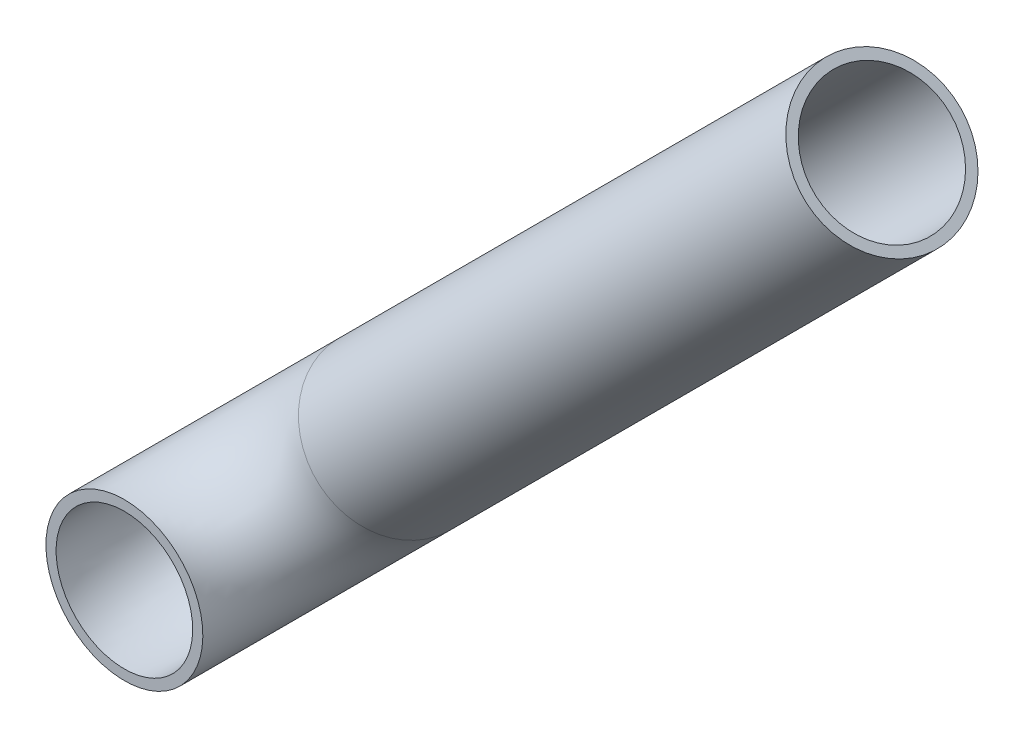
ISO-10303-21;
HEADER;
FILE_DESCRIPTION(('STEP AP214'),'2;1');
FILE_NAME('part.step','',(''),(''),'','','');
FILE_SCHEMA(('AUTOMOTIVE_DESIGN { 1 0 10303 214 1 1 1 1 }'));
ENDSEC;
DATA;
#1=APPLICATION_CONTEXT('core data for automotive mechanical design processes');
#2=APPLICATION_PROTOCOL_DEFINITION('international standard','automotive_design',2000,#1);
#3=PRODUCT_CONTEXT('',#1,'mechanical');
#4=PRODUCT('Part','Part','',(#3));
#5=PRODUCT_RELATED_PRODUCT_CATEGORY('part','',(#4));
#6=PRODUCT_DEFINITION_FORMATION('','',#4);
#7=PRODUCT_DEFINITION_CONTEXT('part definition',#1,'design');
#8=PRODUCT_DEFINITION('design','',#6,#7);
#9=PRODUCT_DEFINITION_SHAPE('','',#8);
#10=(LENGTH_UNIT() NAMED_UNIT(*) SI_UNIT(.MILLI.,.METRE.));
#11=(NAMED_UNIT(*) PLANE_ANGLE_UNIT() SI_UNIT($,.RADIAN.));
#12=(NAMED_UNIT(*) SI_UNIT($,.STERADIAN.) SOLID_ANGLE_UNIT());
#13=UNCERTAINTY_MEASURE_WITH_UNIT(LENGTH_MEASURE(1.E-05),#10,'distance_accuracy_value','');
#14=(GEOMETRIC_REPRESENTATION_CONTEXT(3) GLOBAL_UNCERTAINTY_ASSIGNED_CONTEXT((#13)) GLOBAL_UNIT_ASSIGNED_CONTEXT((#10,
#11,#12)) REPRESENTATION_CONTEXT('',''));
#15=CARTESIAN_POINT('',(0.,0.,0.));
#16=DIRECTION('',(0.,0.,1.));
#17=DIRECTION('',(1.,0.,0.));
#18=AXIS2_PLACEMENT_3D('',#15,#16,#17);
#19=CARTESIAN_POINT('',(43.1052293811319,43.1052293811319,-60.96));
#20=DIRECTION('',(0.707106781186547,0.707106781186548,0.));
#21=DIRECTION('',(-0.707106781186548,0.707106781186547,0.));
#22=AXIS2_PLACEMENT_3D('',#19,#20,#21);
#23=CYLINDRICAL_SURFACE('',#22,30.226);
#24=CARTESIAN_POINT('',(117.375941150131,106.91114115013,-90.2662289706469));
#25=CARTESIAN_POINT('',(117.37594124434,106.619289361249,-90.2141212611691));
#26=CARTESIAN_POINT('',(117.363728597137,106.327464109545,-90.1618780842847));
#27=CARTESIAN_POINT('',(117.314933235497,105.745650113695,-90.0585414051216));
#28=CARTESIAN_POINT('',(117.278350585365,105.455661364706,-90.0074478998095));
#29=CARTESIAN_POINT('',(117.180956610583,104.879306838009,-89.9078315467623));
#30=CARTESIAN_POINT('',(117.120143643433,104.592941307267,-89.8593088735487));
#31=CARTESIAN_POINT('',(116.97456850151,104.025809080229,-89.766254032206));
#32=CARTESIAN_POINT('',(116.889815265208,103.745040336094,-89.7217203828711));
#33=CARTESIAN_POINT('',(116.696499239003,103.190211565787,-89.6378542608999));
#34=CARTESIAN_POINT('',(116.587877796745,102.916169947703,-89.5985349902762));
#35=CARTESIAN_POINT('',(116.347517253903,102.377508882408,-89.526465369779));
#36=CARTESIAN_POINT('',(116.215778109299,102.112889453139,-89.4937150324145));
#37=CARTESIAN_POINT('',(115.930016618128,101.595192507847,-89.4358679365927));
#38=CARTESIAN_POINT('',(115.776001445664,101.342111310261,-89.4107687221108));
#39=CARTESIAN_POINT('',(115.446696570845,100.84944921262,-89.3690662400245));
#40=CARTESIAN_POINT('',(115.271407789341,100.609867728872,-89.3524626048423));
#41=CARTESIAN_POINT('',(114.908398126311,100.155626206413,-89.328822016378));
#42=CARTESIAN_POINT('',(114.721472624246,99.9403489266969,-89.3214235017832));
#43=CARTESIAN_POINT('',(114.330611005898,99.525704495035,-89.3152205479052));
#44=CARTESIAN_POINT('',(114.126675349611,99.3263369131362,-89.3164158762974));
#45=CARTESIAN_POINT('',(113.703363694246,98.9450320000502,-89.3273605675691));
#46=CARTESIAN_POINT('',(113.483989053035,98.7630931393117,-89.3371091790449));
#47=CARTESIAN_POINT('',(113.031472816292,98.4179347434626,-89.3648403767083));
#48=CARTESIAN_POINT('',(112.798331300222,98.2547151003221,-89.3828229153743));
#49=CARTESIAN_POINT('',(112.326838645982,97.9524330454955,-89.4258254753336));
#50=CARTESIAN_POINT('',(112.088822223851,97.8128172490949,-89.4506316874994));
#51=CARTESIAN_POINT('',(111.603034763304,97.5530392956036,-89.5067521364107));
#52=CARTESIAN_POINT('',(111.355260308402,97.4328840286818,-89.538068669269));
#53=CARTESIAN_POINT('',(110.85169365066,97.2127083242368,-89.6063140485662));
#54=CARTESIAN_POINT('',(110.595901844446,97.1126868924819,-89.6432426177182));
#55=CARTESIAN_POINT('',(110.077879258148,96.9332175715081,-89.7217083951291));
#56=CARTESIAN_POINT('',(109.815648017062,96.8537711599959,-89.7632459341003));
#57=CARTESIAN_POINT('',(109.275180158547,96.7128770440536,-89.8516624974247));
#58=CARTESIAN_POINT('',(108.996734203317,96.6523267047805,-89.8986926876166));
#59=CARTESIAN_POINT('',(108.436264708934,96.55416354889,-89.9952880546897));
#60=CARTESIAN_POINT('',(108.154241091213,96.5165512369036,-90.0448532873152));
#61=CARTESIAN_POINT('',(107.588204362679,96.4643988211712,-90.1452202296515));
#62=CARTESIAN_POINT('',(107.304190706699,96.4498653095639,-90.1960222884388));
#63=CARTESIAN_POINT('',(106.735910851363,96.4439504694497,-90.297534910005));
#64=CARTESIAN_POINT('',(106.451644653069,96.4525690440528,-90.3482454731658));
#65=CARTESIAN_POINT('',(105.870987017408,96.4939046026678,-90.4506697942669));
#66=CARTESIAN_POINT('',(105.574663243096,96.5277503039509,-90.5023162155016));
#67=CARTESIAN_POINT('',(104.985604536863,96.6206978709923,-90.6026360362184));
#68=CARTESIAN_POINT('',(104.692868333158,96.6797905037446,-90.6513105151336));
#69=CARTESIAN_POINT('',(104.112830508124,96.8229926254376,-90.7443541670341));
#70=CARTESIAN_POINT('',(103.825529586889,96.90710531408,-90.7887227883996));
#71=CARTESIAN_POINT('',(103.258474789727,97.0999362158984,-90.8718900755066));
#72=CARTESIAN_POINT('',(102.9787206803,97.2086536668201,-90.9106889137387));
#73=CARTESIAN_POINT('',(102.433350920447,97.4481248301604,-90.9810224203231));
#74=CARTESIAN_POINT('',(102.167579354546,97.5784915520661,-91.0126649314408));
#75=CARTESIAN_POINT('',(101.647443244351,97.8616551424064,-91.0685770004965));
#76=CARTESIAN_POINT('',(101.393078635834,98.0144518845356,-91.0928465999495));
#77=CARTESIAN_POINT('',(100.897881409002,98.3413836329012,-91.1333011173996));
#78=CARTESIAN_POINT('',(100.65704455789,98.5155119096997,-91.1494885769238));
#79=CARTESIAN_POINT('',(100.190804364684,98.8838524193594,-91.1733116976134));
#80=CARTESIAN_POINT('',(99.9654003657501,99.078063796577,-91.1809477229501));
#81=CARTESIAN_POINT('',(99.5428129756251,99.4747781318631,-91.1872793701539));
#82=CARTESIAN_POINT('',(99.3447799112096,99.6763702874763,-91.1864060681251));
#83=CARTESIAN_POINT('',(98.9657538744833,100.094797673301,-91.1767703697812));
#84=CARTESIAN_POINT('',(98.7847602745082,100.311632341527,-91.1680082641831));
#85=CARTESIAN_POINT('',(98.4410903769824,100.758920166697,-91.1428307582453));
#86=CARTESIAN_POINT('',(98.278413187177,100.989372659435,-91.1264157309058));
#87=CARTESIAN_POINT('',(97.9724380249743,101.462203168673,-91.0863683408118));
#88=CARTESIAN_POINT('',(97.8291402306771,101.704581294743,-91.0627359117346));
#89=CARTESIAN_POINT('',(97.5640342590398,102.197209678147,-91.0091221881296));
#90=CARTESIAN_POINT('',(97.4420389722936,102.447365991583,-90.979201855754));
#91=CARTESIAN_POINT('',(97.2185428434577,102.956045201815,-90.913626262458));
#92=CARTESIAN_POINT('',(97.1170493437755,103.214571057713,-90.8779689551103));
#93=CARTESIAN_POINT('',(96.9351014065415,103.738209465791,-90.8018099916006));
#94=CARTESIAN_POINT('',(96.8546462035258,104.003321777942,-90.7613085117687));
#95=CARTESIAN_POINT('',(96.7151043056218,104.538514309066,-90.6764420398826));
#96=CARTESIAN_POINT('',(96.656019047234,104.808594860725,-90.6320767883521));
#97=CARTESIAN_POINT('',(96.5573145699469,105.36409323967,-90.5385312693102));
#98=CARTESIAN_POINT('',(96.5186670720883,105.649662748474,-90.4892250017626));
#99=CARTESIAN_POINT('',(96.4650453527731,106.222706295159,-90.3888417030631));
#100=CARTESIAN_POINT('',(96.4500717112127,106.510180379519,-90.3377646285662));
#101=CARTESIAN_POINT('',(96.443838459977,107.085394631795,-90.2351538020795));
#102=CARTESIAN_POINT('',(96.4525860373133,107.373134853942,-90.1836199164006));
#103=CARTESIAN_POINT('',(96.493768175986,107.947073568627,-90.0814709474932));
#104=CARTESIAN_POINT('',(96.5262023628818,108.233272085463,-90.0308558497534));
#105=CARTESIAN_POINT('',(96.6162892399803,108.813064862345,-89.9300559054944));
#106=CARTESIAN_POINT('',(96.6748398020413,109.106535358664,-89.8799579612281));
#107=CARTESIAN_POINT('',(96.8170220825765,109.687885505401,-89.7837391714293));
#108=CARTESIAN_POINT('',(96.9006441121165,109.975767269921,-89.7376167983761));
#109=CARTESIAN_POINT('',(97.0925826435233,110.544030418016,-89.6507642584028));
#110=CARTESIAN_POINT('',(97.2008993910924,110.824411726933,-89.61003414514));
#111=CARTESIAN_POINT('',(97.4416410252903,111.375558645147,-89.5352953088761));
#112=CARTESIAN_POINT('',(97.5740648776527,111.646324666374,-89.5012862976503));
#113=CARTESIAN_POINT('',(97.8581177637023,112.168578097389,-89.4419976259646));
#114=CARTESIAN_POINT('',(98.0090959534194,112.420394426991,-89.4164978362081));
#115=CARTESIAN_POINT('',(98.3320520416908,112.91093212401,-89.3737850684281));
#116=CARTESIAN_POINT('',(98.5040295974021,113.149653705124,-89.3565719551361));
#117=CARTESIAN_POINT('',(98.8676770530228,113.611976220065,-89.3310289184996));
#118=CARTESIAN_POINT('',(99.0593402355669,113.835582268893,-89.3226959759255));
#119=CARTESIAN_POINT('',(99.4609145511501,114.265919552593,-89.3151955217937));
#120=CARTESIAN_POINT('',(99.6708249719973,114.472651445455,-89.3160276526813));
#121=CARTESIAN_POINT('',(100.095462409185,114.856964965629,-89.3265348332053));
#122=CARTESIAN_POINT('',(100.309325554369,115.035515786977,-89.3357326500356));
#123=CARTESIAN_POINT('',(100.750285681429,115.374785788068,-89.3620164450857));
#124=CARTESIAN_POINT('',(100.977382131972,115.535505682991,-89.3791021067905));
#125=CARTESIAN_POINT('',(101.443173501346,115.838095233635,-89.4206384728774));
#126=CARTESIAN_POINT('',(101.681869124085,115.979963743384,-89.4450896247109));
#127=CARTESIAN_POINT('',(102.169167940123,116.244014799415,-89.5006273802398));
#128=CARTESIAN_POINT('',(102.417771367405,116.366196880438,-89.5317141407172));
#129=CARTESIAN_POINT('',(102.925142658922,116.591091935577,-89.5998883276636));
#130=CARTESIAN_POINT('',(103.183973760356,116.693648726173,-89.6370198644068));
#131=CARTESIAN_POINT('',(103.70841100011,116.877675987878,-89.7160837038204));
#132=CARTESIAN_POINT('',(103.974019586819,116.95913871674,-89.7580177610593));
#133=CARTESIAN_POINT('',(104.510309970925,117.100594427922,-89.8455472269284));
#134=CARTESIAN_POINT('',(104.780992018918,117.160586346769,-89.8911428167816));
#135=CARTESIAN_POINT('',(105.325847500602,117.258871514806,-89.9848111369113));
#136=CARTESIAN_POINT('',(105.600021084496,117.297163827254,-90.0328839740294));
#137=CARTESIAN_POINT('',(106.165949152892,117.353464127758,-90.133065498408));
#138=CARTESIAN_POINT('',(106.457818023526,117.370197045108,-90.1852483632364));
#139=CARTESIAN_POINT('',(107.041812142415,117.379198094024,-90.28958105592));
#140=CARTESIAN_POINT('',(107.333937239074,117.371476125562,-90.341730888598));
#141=CARTESIAN_POINT('',(107.916942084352,117.331593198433,-90.4446470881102));
#142=CARTESIAN_POINT('',(108.207821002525,117.299417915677,-90.4954126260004));
#143=CARTESIAN_POINT('',(108.78621130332,117.210739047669,-90.5941487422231));
#144=CARTESIAN_POINT('',(109.073723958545,117.154244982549,-90.6421204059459));
#145=CARTESIAN_POINT('',(109.64936822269,117.01577068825,-90.734928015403));
#146=CARTESIAN_POINT('',(109.937395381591,116.933299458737,-90.7796812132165));
#147=CARTESIAN_POINT('',(110.50604447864,116.74366563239,-90.8636911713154));
#148=CARTESIAN_POINT('',(110.786666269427,116.636502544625,-90.9029478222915));
#149=CARTESIAN_POINT('',(111.338296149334,116.398110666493,-90.9748211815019));
#150=CARTESIAN_POINT('',(111.609306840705,116.266888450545,-91.0074396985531));
#151=CARTESIAN_POINT('',(112.139623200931,115.981186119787,-91.0650878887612));
#152=CARTESIAN_POINT('',(112.398929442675,115.826707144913,-91.0901179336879));
#153=CARTESIAN_POINT('',(112.892980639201,115.502601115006,-91.1309547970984));
#154=CARTESIAN_POINT('',(113.128300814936,115.333893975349,-91.1471076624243));
#155=CARTESIAN_POINT('',(113.584401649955,114.977330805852,-91.1713163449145));
#156=CARTESIAN_POINT('',(113.805182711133,114.789475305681,-91.1793723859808));
#157=CARTESIAN_POINT('',(114.230425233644,114.396059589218,-91.1871588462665));
#158=CARTESIAN_POINT('',(114.434890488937,114.190503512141,-91.1868912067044));
#159=CARTESIAN_POINT('',(114.825980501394,113.763237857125,-91.1780424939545));
#160=CARTESIAN_POINT('',(115.012605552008,113.541528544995,-91.1694615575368));
#161=CARTESIAN_POINT('',(115.359979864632,113.092300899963,-91.1447043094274));
#162=CARTESIAN_POINT('',(115.521437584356,112.865313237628,-91.1288252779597));
#163=CARTESIAN_POINT('',(115.825500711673,112.39963432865,-91.0900055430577));
#164=CARTESIAN_POINT('',(115.968106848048,112.160943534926,-91.0670651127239));
#165=CARTESIAN_POINT('',(116.233648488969,111.67348773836,-91.0147022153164));
#166=CARTESIAN_POINT('',(116.356580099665,111.424720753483,-90.9852784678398));
#167=CARTESIAN_POINT('',(116.582084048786,110.918834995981,-90.9206877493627));
#168=CARTESIAN_POINT('',(116.684654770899,110.661715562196,-90.885520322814));
#169=CARTESIAN_POINT('',(116.876074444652,110.120618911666,-90.8073915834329));
#170=CARTESIAN_POINT('',(116.963245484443,109.836103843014,-90.7640375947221));
#171=CARTESIAN_POINT('',(117.112941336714,109.261356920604,-90.6728775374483));
#172=CARTESIAN_POINT('',(117.175464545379,108.971124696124,-90.6250711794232));
#173=CARTESIAN_POINT('',(117.275602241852,108.386890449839,-90.5263233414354));
#174=CARTESIAN_POINT('',(117.313213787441,108.092887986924,-90.4753814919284));
#175=CARTESIAN_POINT('',(117.36338733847,107.502962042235,-90.3717495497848));
#176=CARTESIAN_POINT('',(117.375941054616,107.207037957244,-90.3190588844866));
#177=CARTESIAN_POINT('',(117.375941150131,106.91114115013,-90.2662289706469));
#178=B_SPLINE_CURVE_WITH_KNOTS('',3,(#24,#25,#26,#27,#28,#29,#30,#31,#32,#33,#34,#35,#36,#37,
#38,#39,#40,#41,#42,#43,#44,#45,#46,#47,#48,#49,#50,#51,#52,#53,#54,#55,#56,#57,#58,#59,#60,#61,
#62,#63,#64,#65,#66,#67,#68,#69,#70,#71,#72,#73,#74,#75,#76,#77,#78,#79,#80,#81,#82,#83,#84,#85,
#86,#87,#88,#89,#90,#91,#92,#93,#94,#95,#96,#97,#98,#99,#100,#101,#102,#103,#104,#105,#106,#107,
#108,#109,#110,#111,#112,#113,#114,#115,#116,#117,#118,#119,#120,#121,#122,#123,#124,#125,#126,
#127,#128,#129,#130,#131,#132,#133,#134,#135,#136,#137,#138,#139,#140,#141,#142,#143,#144,#145,
#146,#147,#148,#149,#150,#151,#152,#153,#154,#155,#156,#157,#158,#159,#160,#161,#162,#163,#164,
#165,#166,#167,#168,#169,#170,#171,#172,#173,#174,#175,#176,#177),.UNSPECIFIED.,.T.,.F.,(4,2,2,
2,2,2,2,2,2,2,2,2,2,2,2,2,2,2,2,2,2,2,2,2,2,2,2,2,2,2,2,2,2,2,2,2,2,2,2,2,2,2,2,2,2,2,2,2,2,2,2,
2,2,2,2,2,2,2,2,2,2,2,2,2,2,2,2,2,2,2,2,2,2,2,2,2,4),(0.,0.889145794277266,1.7782892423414,
2.66749297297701,3.55636514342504,4.44744650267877,5.33852955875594,6.22932627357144,
7.12008444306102,7.97462116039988,8.82913477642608,9.68357333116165,10.5380069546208,
11.3682339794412,12.1987543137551,13.0292336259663,13.8597725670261,14.7252370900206,
15.5907206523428,16.4564513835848,17.3221784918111,18.2291573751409,19.1358048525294,
20.0425683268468,20.949303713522,21.8412978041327,22.7332868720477,23.6249952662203,
24.5166656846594,25.3634093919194,26.210121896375,27.056793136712,27.903472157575,
28.7422928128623,29.5814133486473,30.4205033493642,31.2596497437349,32.135746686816,
33.0118650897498,33.888248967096,34.7646189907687,35.6737678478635,36.5825658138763,
37.4913728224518,38.4001408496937,39.2831471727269,40.1661390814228,41.0488306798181,
41.9314878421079,42.7667494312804,43.601977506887,44.4372563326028,45.2725548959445,
46.114247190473,46.9562479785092,47.7982904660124,48.6403693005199,49.5302570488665,
50.4197845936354,51.3098336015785,52.1995344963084,53.1071778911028,54.0148393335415,
54.9222531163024,55.8296224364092,56.6985218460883,57.567397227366,58.436069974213,
59.3047284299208,60.1407714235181,60.9767820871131,61.812958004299,62.6492002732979,
63.550206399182,64.4512711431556,65.3524422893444,66.2539114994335),.UNSPECIFIED.);
#179=CARTESIAN_POINT('',(117.375941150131,106.91114115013,-90.2662289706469));
#180=VERTEX_POINT('',#179);
#181=EDGE_CURVE('E57',#180,#180,#178,.T.);
#182=ORIENTED_EDGE('',*,*,#181,.F.);
#183=EDGE_LOOP('',(#182));
#184=FACE_BOUND('',#183,.T.);
#185=CARTESIAN_POINT('',(43.1052293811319,43.1052293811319,-60.96));
#186=DIRECTION('',(-0.707106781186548,-0.707106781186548,0.));
#187=DIRECTION('',(0.5,-0.5,0.707106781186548));
#188=AXIS2_PLACEMENT_3D('',#185,#186,#187);
#189=CIRCLE('',#188,30.226);
#190=CARTESIAN_POINT('',(43.1052293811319,43.1052293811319,-91.186));
#191=VERTEX_POINT('',#190);
#192=EDGE_CURVE('E43',#191,#191,#189,.T.);
#193=ORIENTED_EDGE('',*,*,#192,.F.);
#194=EDGE_LOOP('',(#193));
#195=FACE_BOUND('',#194,.T.);
#196=CARTESIAN_POINT('',(230.857687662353,230.857687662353,-60.96));
#197=DIRECTION('',(-0.707106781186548,-0.707106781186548,0.));
#198=DIRECTION('',(0.5,-0.5,0.707106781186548));
#199=AXIS2_PLACEMENT_3D('',#196,#197,#198);
#200=CIRCLE('',#199,30.226);
#201=CARTESIAN_POINT('',(245.970687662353,215.744687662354,-39.5869904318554));
#202=VERTEX_POINT('',#201);
#203=EDGE_CURVE('E10',#202,#202,#200,.T.);
#204=ORIENTED_EDGE('',*,*,#203,.T.);
#205=EDGE_LOOP('',(#204));
#206=FACE_BOUND('',#205,.T.);
#207=ADVANCED_FACE('F29',(#184,#195,#206),#23,.T.);
#208=CARTESIAN_POINT('',(43.1052293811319,43.1052293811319,-60.96));
#209=DIRECTION('',(0.707106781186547,0.707106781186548,0.));
#210=DIRECTION('',(-0.707106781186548,0.707106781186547,0.));
#211=AXIS2_PLACEMENT_3D('',#208,#209,#210);
#212=CYLINDRICAL_SURFACE('',#211,26.3144);
#213=CARTESIAN_POINT('',(117.375941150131,106.91114115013,-86.2125568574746));
#214=CARTESIAN_POINT('',(117.3759401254,107.200780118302,-86.2725705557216));
#215=CARTESIAN_POINT('',(117.363909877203,107.490543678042,-86.3323945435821));
#216=CARTESIAN_POINT('',(117.315781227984,108.068590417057,-86.4500939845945));
#217=CARTESIAN_POINT('',(117.279669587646,108.356872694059,-86.5079683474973));
#218=CARTESIAN_POINT('',(117.183343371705,108.930722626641,-86.620362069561));
#219=CARTESIAN_POINT('',(117.123077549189,109.216283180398,-86.6748740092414));
#220=CARTESIAN_POINT('',(116.97862950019,109.782203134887,-86.7789687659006));
#221=CARTESIAN_POINT('',(116.894448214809,110.062562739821,-86.8285517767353));
#222=CARTESIAN_POINT('',(116.702320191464,110.616676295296,-86.9215486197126));
#223=CARTESIAN_POINT('',(116.594330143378,110.890417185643,-86.9649509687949));
#224=CARTESIAN_POINT('',(116.355190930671,111.428740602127,-87.0442828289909));
#225=CARTESIAN_POINT('',(116.224040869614,111.69332277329,-87.0802120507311));
#226=CARTESIAN_POINT('',(115.939472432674,112.210993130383,-87.1435489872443));
#227=CARTESIAN_POINT('',(115.786074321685,112.464091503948,-87.1709643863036));
#228=CARTESIAN_POINT('',(115.457950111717,112.956943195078,-87.2165206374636));
#229=CARTESIAN_POINT('',(115.283225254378,113.196697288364,-87.2346620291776));
#230=CARTESIAN_POINT('',(114.922588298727,113.649726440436,-87.2605035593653));
#231=CARTESIAN_POINT('',(114.737609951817,113.863719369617,-87.268661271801));
#232=CARTESIAN_POINT('',(114.350851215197,114.276102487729,-87.2758637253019));
#233=CARTESIAN_POINT('',(114.149071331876,114.474493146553,-87.2749087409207));
#234=CARTESIAN_POINT('',(113.73025103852,114.854167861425,-87.2639120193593));
#235=CARTESIAN_POINT('',(113.513210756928,115.035452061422,-87.2538703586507));
#236=CARTESIAN_POINT('',(113.065552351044,115.379610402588,-87.2249727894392));
#237=CARTESIAN_POINT('',(112.834934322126,115.542484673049,-87.2061169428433));
#238=CARTESIAN_POINT('',(112.369009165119,115.844136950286,-87.1607886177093));
#239=CARTESIAN_POINT('',(112.134050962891,115.983491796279,-87.1345619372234));
#240=CARTESIAN_POINT('',(111.654688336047,116.243080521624,-87.0749406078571));
#241=CARTESIAN_POINT('',(111.410284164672,116.363314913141,-87.0415461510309));
#242=CARTESIAN_POINT('',(110.913681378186,116.584069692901,-86.9683959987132));
#243=CARTESIAN_POINT('',(110.661483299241,116.684591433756,-86.9286407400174));
#244=CARTESIAN_POINT('',(110.150776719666,116.865548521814,-86.8436860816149));
#245=CARTESIAN_POINT('',(109.892265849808,116.945976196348,-86.7984846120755));
#246=CARTESIAN_POINT('',(109.359267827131,117.089458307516,-86.7016359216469));
#247=CARTESIAN_POINT('',(109.084573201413,117.151611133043,-86.6497944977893));
#248=CARTESIAN_POINT('',(108.531651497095,117.253531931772,-86.5425830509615));
#249=CARTESIAN_POINT('',(108.25342322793,117.293292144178,-86.487211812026));
#250=CARTESIAN_POINT('',(107.695050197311,117.350312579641,-86.3742901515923));
#251=CARTESIAN_POINT('',(107.414905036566,117.367567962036,-86.3167392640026));
#252=CARTESIAN_POINT('',(106.854285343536,117.379542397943,-86.2008692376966));
#253=CARTESIAN_POINT('',(106.573810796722,117.374260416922,-86.1425500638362));
#254=CARTESIAN_POINT('',(105.996792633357,117.340167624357,-86.0230094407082));
#255=CARTESIAN_POINT('',(105.700323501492,117.309927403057,-85.9618305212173));
#256=CARTESIAN_POINT('',(105.110646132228,117.224190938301,-85.8420015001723));
#257=CARTESIAN_POINT('',(104.81743683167,117.16870319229,-85.783350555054));
#258=CARTESIAN_POINT('',(104.235927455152,117.032626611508,-85.6702794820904));
#259=CARTESIAN_POINT('',(103.947629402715,116.95202768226,-85.6158610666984));
#260=CARTESIAN_POINT('',(103.378163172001,116.766077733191,-85.513015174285));
#261=CARTESIAN_POINT('',(103.096991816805,116.660737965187,-85.4645849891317));
#262=CARTESIAN_POINT('',(102.5465228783,116.426951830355,-85.3757504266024));
#263=CARTESIAN_POINT('',(102.277134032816,116.298749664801,-85.3352699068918));
#264=CARTESIAN_POINT('',(101.749370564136,116.019232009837,-85.2631313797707));
#265=CARTESIAN_POINT('',(101.49099592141,115.86791656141,-85.2314733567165));
#266=CARTESIAN_POINT('',(100.987599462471,115.543252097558,-85.1781512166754));
#267=CARTESIAN_POINT('',(100.742569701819,115.369916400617,-85.1564810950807));
#268=CARTESIAN_POINT('',(100.26787903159,115.002443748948,-85.1239331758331));
#269=CARTESIAN_POINT('',(100.038216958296,114.808308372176,-85.1130545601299));
#270=CARTESIAN_POINT('',(99.6131310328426,114.416353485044,-85.102909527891));
#271=CARTESIAN_POINT('',(99.4164316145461,114.219935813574,-85.1028232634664));
#272=CARTESIAN_POINT('',(99.0393932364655,113.812207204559,-85.1122209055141));
#273=CARTESIAN_POINT('',(98.8590533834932,113.600897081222,-85.1217042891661));
#274=CARTESIAN_POINT('',(98.5160145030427,113.165005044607,-85.1499246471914));
#275=CARTESIAN_POINT('',(98.3533154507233,112.940423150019,-85.1686616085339));
#276=CARTESIAN_POINT('',(98.0466095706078,112.479687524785,-85.2147782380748));
#277=CARTESIAN_POINT('',(97.9026029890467,112.243533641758,-85.2421580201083));
#278=CARTESIAN_POINT('',(97.636651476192,111.765950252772,-85.3041065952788));
#279=CARTESIAN_POINT('',(97.5143404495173,111.52470530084,-85.3385294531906));
#280=CARTESIAN_POINT('',(97.2890366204,111.034246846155,-85.4138841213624));
#281=CARTESIAN_POINT('',(97.1860506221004,110.785030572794,-85.4548182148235));
#282=CARTESIAN_POINT('',(96.9998547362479,110.280238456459,-85.5420652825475));
#283=CARTESIAN_POINT('',(96.9166452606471,110.024662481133,-85.588378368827));
#284=CARTESIAN_POINT('',(96.7702730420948,109.508598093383,-85.6851816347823));
#285=CARTESIAN_POINT('',(96.7071119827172,109.248109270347,-85.7356721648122));
#286=CARTESIAN_POINT('',(96.5973933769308,108.705676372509,-85.8431356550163));
#287=CARTESIAN_POINT('',(96.5522667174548,108.423483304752,-85.9003157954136));
#288=CARTESIAN_POINT('',(96.485242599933,107.856718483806,-86.0164762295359));
#289=CARTESIAN_POINT('',(96.4633459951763,107.572146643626,-86.0754565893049));
#290=CARTESIAN_POINT('',(96.4428496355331,107.002116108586,-86.193704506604));
#291=CARTESIAN_POINT('',(96.444258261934,106.716657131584,-86.2529721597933));
#292=CARTESIAN_POINT('',(96.4704094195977,106.146559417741,-86.3702652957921));
#293=CARTESIAN_POINT('',(96.4951515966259,105.861920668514,-86.4282907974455));
#294=CARTESIAN_POINT('',(96.5698009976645,105.280504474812,-86.5445565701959));
#295=CARTESIAN_POINT('',(96.6209363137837,104.983855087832,-86.6026545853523));
#296=CARTESIAN_POINT('',(96.7487856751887,104.395350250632,-86.7142209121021));
#297=CARTESIAN_POINT('',(96.8254898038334,104.103492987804,-86.7676910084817));
#298=CARTESIAN_POINT('',(97.004191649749,103.526530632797,-86.8685140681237));
#299=CARTESIAN_POINT('',(97.1061891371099,103.241425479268,-86.9158670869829));
#300=CARTESIAN_POINT('',(97.3349901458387,102.680160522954,-87.0030821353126));
#301=CARTESIAN_POINT('',(97.4617923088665,102.404000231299,-87.0429445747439));
#302=CARTESIAN_POINT('',(97.7343805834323,101.872794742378,-87.1126932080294));
#303=CARTESIAN_POINT('',(97.8793016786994,101.617346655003,-87.1428912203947));
#304=CARTESIAN_POINT('',(98.1905722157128,101.118901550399,-87.1943799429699));
#305=CARTESIAN_POINT('',(98.3569212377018,100.875904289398,-87.215670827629));
#306=CARTESIAN_POINT('',(98.7097986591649,100.404476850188,-87.2487210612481));
#307=CARTESIAN_POINT('',(98.8963195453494,100.176041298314,-87.260483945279));
#308=CARTESIAN_POINT('',(99.2881395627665,99.7355745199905,-87.2741438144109));
#309=CARTESIAN_POINT('',(99.4934378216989,99.5235425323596,-87.276041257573));
#310=CARTESIAN_POINT('',(99.9079078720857,99.1301843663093,-87.270106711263));
#311=CARTESIAN_POINT('',(100.116057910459,98.9477706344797,-87.2628681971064));
#312=CARTESIAN_POINT('',(100.545851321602,98.6002148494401,-87.2398507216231));
#313=CARTESIAN_POINT('',(100.767494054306,98.4350719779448,-87.2240721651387));
#314=CARTESIAN_POINT('',(101.222634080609,98.1231353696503,-87.1843809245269));
#315=CARTESIAN_POINT('',(101.456131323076,97.9763415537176,-87.1604682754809));
#316=CARTESIAN_POINT('',(101.933297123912,97.701968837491,-87.1051133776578));
#317=CARTESIAN_POINT('',(102.176965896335,97.5743903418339,-87.0736709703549));
#318=CARTESIAN_POINT('',(102.673252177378,97.338893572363,-87.0039675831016));
#319=CARTESIAN_POINT('',(102.925885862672,97.2310132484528,-86.9656937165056));
#320=CARTESIAN_POINT('',(103.438088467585,97.0356612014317,-86.8832794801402));
#321=CARTESIAN_POINT('',(103.69765983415,96.9481967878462,-86.8391370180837));
#322=CARTESIAN_POINT('',(104.222057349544,96.7940486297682,-86.7460372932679));
#323=CARTESIAN_POINT('',(104.486883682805,96.7273656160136,-86.697079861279));
#324=CARTESIAN_POINT('',(105.020260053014,96.6149817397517,-86.5954835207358));
#325=CARTESIAN_POINT('',(105.288810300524,96.5692820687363,-86.5428444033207));
#326=CARTESIAN_POINT('',(105.844859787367,96.4968010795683,-86.4317531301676));
#327=CARTESIAN_POINT('',(106.132503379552,96.4713652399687,-86.3731428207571));
#328=CARTESIAN_POINT('',(106.708646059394,96.4443263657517,-86.2546342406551));
#329=CARTESIAN_POINT('',(106.997145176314,96.442724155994,-86.1947359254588));
#330=CARTESIAN_POINT('',(107.573443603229,96.4633397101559,-86.0751873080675));
#331=CARTESIAN_POINT('',(107.861242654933,96.4855652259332,-86.0155370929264));
#332=CARTESIAN_POINT('',(108.434430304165,96.5537794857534,-85.8980843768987));
#333=CARTESIAN_POINT('',(108.719818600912,96.5997711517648,-85.8402821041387));
#334=CARTESIAN_POINT('',(109.297926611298,96.7177218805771,-85.7258598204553));
#335=CARTESIAN_POINT('',(109.59047663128,96.7906550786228,-85.669381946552));
#336=CARTESIAN_POINT('',(110.169003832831,96.9618032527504,-85.5619553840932));
#337=CARTESIAN_POINT('',(110.454983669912,97.0600078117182,-85.5110044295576));
#338=CARTESIAN_POINT('',(111.018355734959,97.2812713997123,-85.4163036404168));
#339=CARTESIAN_POINT('',(111.295749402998,97.4043262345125,-85.372552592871));
#340=CARTESIAN_POINT('',(111.839774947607,97.6746458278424,-85.29378600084));
#341=CARTESIAN_POINT('',(112.106407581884,97.8219088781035,-85.2587698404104));
#342=CARTESIAN_POINT('',(112.613951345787,98.1319570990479,-85.2002355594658));
#343=CARTESIAN_POINT('',(112.855482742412,98.2936370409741,-85.1762405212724));
#344=CARTESIAN_POINT('',(113.324754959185,98.6369581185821,-85.1381785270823));
#345=CARTESIAN_POINT('',(113.552496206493,98.8185986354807,-85.1241112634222));
#346=CARTESIAN_POINT('',(113.992155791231,99.2003698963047,-85.1064217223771));
#347=CARTESIAN_POINT('',(114.204081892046,99.4004914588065,-85.1027942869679));
#348=CARTESIAN_POINT('',(114.610455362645,99.8176665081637,-85.1061046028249));
#349=CARTESIAN_POINT('',(114.804903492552,100.034719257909,-85.1130418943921));
#350=CARTESIAN_POINT('',(115.162428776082,100.468933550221,-85.13641488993));
#351=CARTESIAN_POINT('',(115.32673317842,100.685122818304,-85.1521864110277));
#352=CARTESIAN_POINT('',(115.637726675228,101.129082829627,-85.192207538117));
#353=CARTESIAN_POINT('',(115.784415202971,101.356853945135,-85.2164574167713));
#354=CARTESIAN_POINT('',(116.059419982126,101.822506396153,-85.2727152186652));
#355=CARTESIAN_POINT('',(116.18772393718,102.060394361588,-85.3047282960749));
#356=CARTESIAN_POINT('',(116.425211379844,102.544539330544,-85.3755681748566));
#357=CARTESIAN_POINT('',(116.534394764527,102.790796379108,-85.4143950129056));
#358=CARTESIAN_POINT('',(116.735755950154,103.296589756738,-85.4988622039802));
#359=CARTESIAN_POINT('',(116.827421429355,103.556304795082,-85.5446526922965));
#360=CARTESIAN_POINT('',(116.989818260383,104.081332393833,-85.6410026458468));
#361=CARTESIAN_POINT('',(117.060549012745,104.346645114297,-85.6915622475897));
#362=CARTESIAN_POINT('',(117.180747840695,104.880857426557,-85.7960243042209));
#363=CARTESIAN_POINT('',(117.230254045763,105.149749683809,-85.8499205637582));
#364=CARTESIAN_POINT('',(117.308037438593,105.690063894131,-85.959774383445));
#365=CARTESIAN_POINT('',(117.336324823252,105.961484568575,-86.0157309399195));
#366=CARTESIAN_POINT('',(117.361296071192,106.34626313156,-86.0953990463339));
#367=CARTESIAN_POINT('',(117.366787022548,106.459166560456,-86.1188170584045));
#368=CARTESIAN_POINT('',(117.374109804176,106.685087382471,-86.1656852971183));
#369=CARTESIAN_POINT('',(117.375941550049,106.79810477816,-86.1891355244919));
#370=CARTESIAN_POINT('',(117.375941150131,106.91114115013,-86.2125568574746));
#371=B_SPLINE_CURVE_WITH_KNOTS('',3,(#213,#214,#215,#216,#217,#218,#219,#220,#221,#222,#223,
#224,#225,#226,#227,#228,#229,#230,#231,#232,#233,#234,#235,#236,#237,#238,#239,#240,#241,#242,
#243,#244,#245,#246,#247,#248,#249,#250,#251,#252,#253,#254,#255,#256,#257,#258,#259,#260,#261,
#262,#263,#264,#265,#266,#267,#268,#269,#270,#271,#272,#273,#274,#275,#276,#277,#278,#279,#280,
#281,#282,#283,#284,#285,#286,#287,#288,#289,#290,#291,#292,#293,#294,#295,#296,#297,#298,#299,
#300,#301,#302,#303,#304,#305,#306,#307,#308,#309,#310,#311,#312,#313,#314,#315,#316,#317,#318,
#319,#320,#321,#322,#323,#324,#325,#326,#327,#328,#329,#330,#331,#332,#333,#334,#335,#336,#337,
#338,#339,#340,#341,#342,#343,#344,#345,#346,#347,#348,#349,#350,#351,#352,#353,#354,#355,#356,
#357,#358,#359,#360,#361,#362,#363,#364,#365,#366,#367,#368,#369,#370),.UNSPECIFIED.,.T.,.F.,(4,
2,2,2,2,2,2,2,2,2,2,2,2,2,2,2,2,2,2,2,2,2,2,2,2,2,2,2,2,2,2,2,2,2,2,2,2,2,2,2,2,2,2,2,2,2,2,2,2,
2,2,2,2,2,2,2,2,2,2,2,2,2,2,2,2,2,2,2,2,2,2,2,2,2,2,2,2,2,4),(0.,0.887271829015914,
1.77503185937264,2.66468546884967,3.55430407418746,4.44555452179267,5.33683947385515,
6.22731762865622,7.11774396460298,7.9656148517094,8.8134601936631,9.6612984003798,
10.5091306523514,11.3314960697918,12.1538394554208,12.9761263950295,13.798726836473,
14.6568970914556,15.5153645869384,16.3740167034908,17.2327082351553,18.1442980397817,
19.0555812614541,19.9672312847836,20.8784675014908,21.780497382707,22.6825256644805,
23.5840109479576,24.4854278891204,25.3183230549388,26.1511727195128,26.9840212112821,
27.8168806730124,28.6339704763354,29.4513474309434,30.2687414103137,31.0862040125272,
31.9595714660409,32.8329709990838,33.7066846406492,34.5803850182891,35.4989926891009,
36.4172444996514,37.3354879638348,38.2536811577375,39.1382572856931,40.0228160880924,
40.907046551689,41.7912359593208,42.6208343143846,43.4503933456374,44.2799487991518,
45.109521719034,45.9406763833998,46.7721281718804,47.6036091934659,48.4351374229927,
49.3181145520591,50.2011222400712,51.0844172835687,51.9678209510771,52.8869188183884,
53.8056384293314,54.7242031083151,55.6427029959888,56.5164707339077,57.3902113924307,
58.2635202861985,59.1367911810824,59.9518337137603,60.766902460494,61.5825138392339,
62.3981296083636,63.2348207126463,64.071535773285,64.9067413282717,65.7415452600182,
66.0878097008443,66.4340821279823),.UNSPECIFIED.);
#372=CARTESIAN_POINT('',(117.375941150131,106.91114115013,-86.2125568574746));
#373=VERTEX_POINT('',#372);
#374=EDGE_CURVE('E32',#373,#373,#371,.T.);
#375=ORIENTED_EDGE('',*,*,#374,.F.);
#376=EDGE_LOOP('',(#375));
#377=FACE_BOUND('',#376,.T.);
#378=CARTESIAN_POINT('',(43.1052293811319,43.1052293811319,-60.96));
#379=DIRECTION('',(-0.707106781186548,-0.707106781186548,0.));
#380=DIRECTION('',(0.5,-0.5,0.707106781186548));
#381=AXIS2_PLACEMENT_3D('',#378,#379,#380);
#382=CIRCLE('',#381,26.3144);
#383=CARTESIAN_POINT('',(43.1052293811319,43.1052293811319,-87.2744));
#384=VERTEX_POINT('',#383);
#385=EDGE_CURVE('E48',#384,#384,#382,.T.);
#386=ORIENTED_EDGE('',*,*,#385,.T.);
#387=EDGE_LOOP('',(#386));
#388=FACE_BOUND('',#387,.T.);
#389=CARTESIAN_POINT('',(230.857687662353,230.857687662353,-60.96));
#390=DIRECTION('',(-0.707106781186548,-0.707106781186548,0.));
#391=DIRECTION('',(0.5,-0.5,0.707106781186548));
#392=AXIS2_PLACEMENT_3D('',#389,#390,#391);
#393=CIRCLE('',#392,26.3144);
#394=CARTESIAN_POINT('',(244.014887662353,217.700487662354,-42.3529093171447));
#395=VERTEX_POINT('',#394);
#396=EDGE_CURVE('E39',#395,#395,#393,.T.);
#397=ORIENTED_EDGE('',*,*,#396,.F.);
#398=EDGE_LOOP('',(#397));
#399=FACE_BOUND('',#398,.T.);
#400=ADVANCED_FACE('F78',(#377,#388,#399),#212,.F.);
#401=CARTESIAN_POINT('',(43.105229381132,43.105229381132,0.));
#402=DIRECTION('',(-0.707106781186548,0.707106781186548,0.));
#403=DIRECTION('',(-0.707106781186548,-0.707106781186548,0.));
#404=AXIS2_PLACEMENT_3D('',#401,#402,#403);
#405=TOROIDAL_SURFACE('',#404,60.96,26.3144);
#406=CARTESIAN_POINT('',(0.,0.,0.));
#407=DIRECTION('',(0.,0.,1.));
#408=DIRECTION('',(1.,0.,0.));
#409=AXIS2_PLACEMENT_3D('',#406,#407,#408);
#410=CIRCLE('',#409,26.3144);
#411=CARTESIAN_POINT('',(-18.6070906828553,-18.6070906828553,0.));
#412=VERTEX_POINT('',#411);
#413=EDGE_CURVE('E54',#412,#412,#410,.T.);
#414=CARTESIAN_POINT('',(43.105229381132,43.105229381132,0.));
#415=DIRECTION('',(-0.707106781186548,0.707106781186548,0.));
#416=DIRECTION('',(-0.707106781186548,-0.707106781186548,0.));
#417=AXIS2_PLACEMENT_3D('',#414,#415,#416);
#418=CIRCLE('',#417,87.2744);
#419=EDGE_CURVE('',#384,#412,#418,.T.);
#420=ORIENTED_EDGE('',*,*,#385,.F.);
#421=ORIENTED_EDGE('',*,*,#413,.T.);
#422=ORIENTED_EDGE('',*,*,#419,.T.);
#423=ORIENTED_EDGE('',*,*,#419,.F.);
#424=EDGE_LOOP('',(#420,#422,#421,#423));
#425=FACE_BOUND('',#424,.T.);
#426=ADVANCED_FACE('F75',(#425),#405,.F.);
#427=CARTESIAN_POINT('',(43.105229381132,43.105229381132,0.));
#428=DIRECTION('',(-0.707106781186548,0.707106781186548,0.));
#429=DIRECTION('',(-0.707106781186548,-0.707106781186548,0.));
#430=AXIS2_PLACEMENT_3D('',#427,#428,#429);
#431=TOROIDAL_SURFACE('',#430,60.96,30.226);
#432=CARTESIAN_POINT('',(0.,0.,0.));
#433=DIRECTION('',(0.,0.,1.));
#434=DIRECTION('',(1.,0.,0.));
#435=AXIS2_PLACEMENT_3D('',#432,#433,#434);
#436=CIRCLE('',#435,30.226);
#437=CARTESIAN_POINT('',(-21.3730095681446,-21.3730095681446,0.));
#438=VERTEX_POINT('',#437);
#439=EDGE_CURVE('E51',#438,#438,#436,.T.);
#440=CARTESIAN_POINT('',(43.105229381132,43.105229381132,0.));
#441=DIRECTION('',(-0.707106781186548,0.707106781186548,0.));
#442=DIRECTION('',(-0.707106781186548,-0.707106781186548,0.));
#443=AXIS2_PLACEMENT_3D('',#440,#441,#442);
#444=CIRCLE('',#443,91.186);
#445=EDGE_CURVE('',#191,#438,#444,.T.);
#446=ORIENTED_EDGE('',*,*,#192,.T.);
#447=ORIENTED_EDGE('',*,*,#439,.F.);
#448=ORIENTED_EDGE('',*,*,#445,.T.);
#449=ORIENTED_EDGE('',*,*,#445,.F.);
#450=EDGE_LOOP('',(#446,#448,#447,#449));
#451=FACE_BOUND('',#450,.T.);
#452=ADVANCED_FACE('F71',(#451),#431,.T.);
#453=CARTESIAN_POINT('',(230.857687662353,230.857687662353,-60.96));
#454=DIRECTION('',(-0.707106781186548,-0.707106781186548,0.));
#455=DIRECTION('',(0.5,-0.5,0.707106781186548));
#456=AXIS2_PLACEMENT_3D('',#453,#454,#455);
#457=PLANE('',#456);
#458=ORIENTED_EDGE('',*,*,#396,.T.);
#459=EDGE_LOOP('',(#458));
#460=FACE_BOUND('',#459,.T.);
#461=ORIENTED_EDGE('',*,*,#203,.F.);
#462=EDGE_LOOP('',(#461));
#463=FACE_BOUND('',#462,.T.);
#464=ADVANCED_FACE('F69',(#460,#463),#457,.F.);
#465=CARTESIAN_POINT('',(0.,0.,0.));
#466=DIRECTION('',(0.,0.,1.));
#467=DIRECTION('',(1.,0.,0.));
#468=AXIS2_PLACEMENT_3D('',#465,#466,#467);
#469=PLANE('',#468);
#470=ORIENTED_EDGE('',*,*,#413,.F.);
#471=EDGE_LOOP('',(#470));
#472=FACE_BOUND('',#471,.T.);
#473=ORIENTED_EDGE('',*,*,#439,.T.);
#474=EDGE_LOOP('',(#473));
#475=FACE_BOUND('',#474,.T.);
#476=ADVANCED_FACE('F66',(#472,#475),#469,.T.);
#477=CARTESIAN_POINT('',(106.911141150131,106.91114115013,-91.187));
#478=DIRECTION('',(0.,0.,1.));
#479=DIRECTION('',(1.,0.,0.));
#480=AXIS2_PLACEMENT_3D('',#477,#478,#479);
#481=CYLINDRICAL_SURFACE('',#480,10.4648);
#482=ORIENTED_EDGE('',*,*,#374,.T.);
#483=EDGE_LOOP('',(#482));
#484=FACE_BOUND('',#483,.T.);
#485=ORIENTED_EDGE('',*,*,#181,.T.);
#486=EDGE_LOOP('',(#485));
#487=FACE_BOUND('',#486,.T.);
#488=ADVANCED_FACE('F62',(#484,#487),#481,.F.);
#489=CLOSED_SHELL('',(#207,#400,#426,#452,#464,#476,#488));
#490=MANIFOLD_SOLID_BREP('B2',#489);
#491=ADVANCED_BREP_SHAPE_REPRESENTATION('',(#18,#490),#14);
#492=SHAPE_DEFINITION_REPRESENTATION(#9,#491);
ENDSEC;
END-ISO-10303-21;
